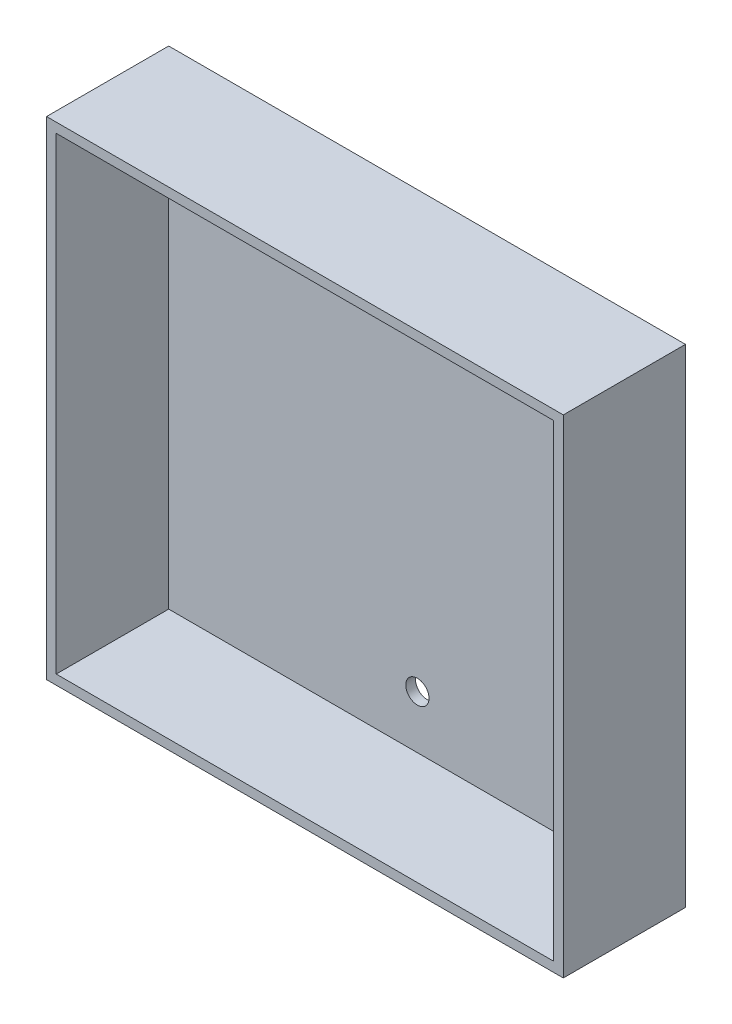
from build123d import *

# Parameters (mm, degrees)
ESQUISSE1_W             = 53.3
ESQUISSE1_H             = 50.3
EXTRUSION1_DEPTH        = 12.6
COQUE1_T                = -1
ESQUISSE2_R             = 1.2
ENL_V_MAT_EXTRU_1_DEPTH = 75.199326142


with BuildPart() as part:
    # Esquisse1 → Extrusion1 (new body)
    with BuildSketch(Plane.XY):
        with Locations((26.65, 25.15)):
            Rectangle(ESQUISSE1_W, ESQUISSE1_H)
    extrude(amount=EXTRUSION1_DEPTH)

    # Coque1
    coque1_openings = [part.faces().sort_by_distance(p)[0] for p in [
        (26.65, 25.15, 12.6),
    ]]
    offset(amount=COQUE1_T, openings=coque1_openings, kind=Kind.INTERSECTION)

    # Esquisse2 → Enl_v. mat.-Extru.1 (cut, through all)
    with BuildSketch(Plane.XY.offset(1)):
        with Locations((26.65, 43.85)):
            Circle(ESQUISSE2_R)
        with Locations((26.65, 6.45)):
            Circle(ESQUISSE2_R)
    extrude(amount=-ENL_V_MAT_EXTRU_1_DEPTH, mode=Mode.SUBTRACT)


solid = part.part
